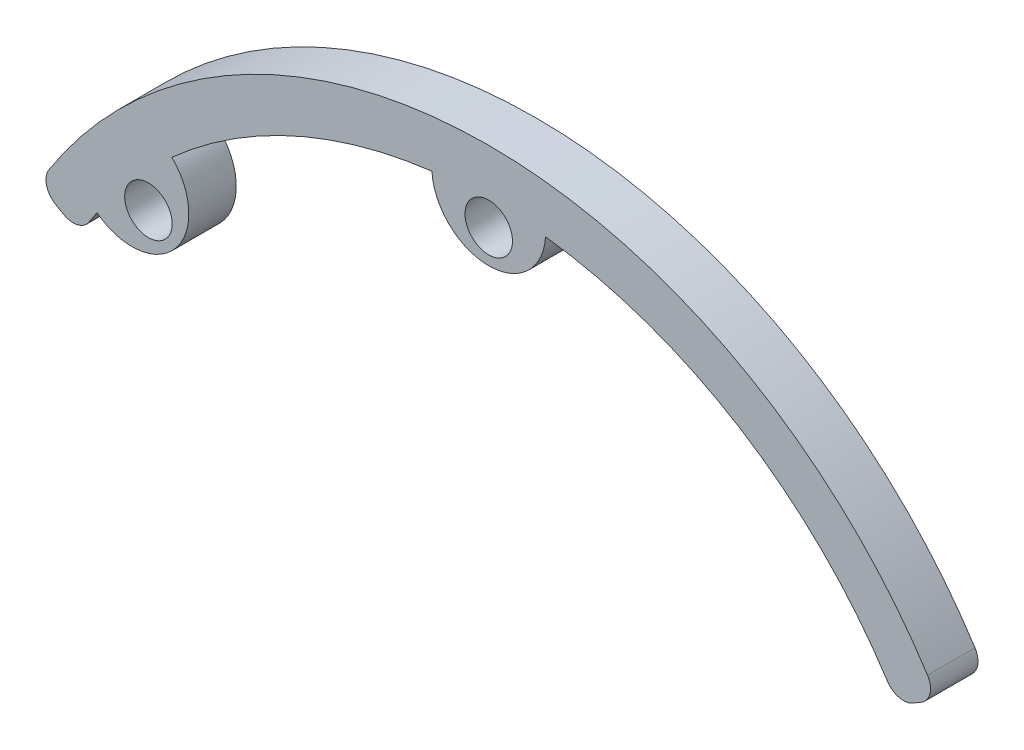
ISO-10303-21;
HEADER;
FILE_DESCRIPTION(('STEP AP214'),'2;1');
FILE_NAME('part.step','',(''),(''),'','','');
FILE_SCHEMA(('AUTOMOTIVE_DESIGN { 1 0 10303 214 1 1 1 1 }'));
ENDSEC;
DATA;
#1=APPLICATION_CONTEXT('core data for automotive mechanical design processes');
#2=APPLICATION_PROTOCOL_DEFINITION('international standard','automotive_design',2000,#1);
#3=PRODUCT_CONTEXT('',#1,'mechanical');
#4=PRODUCT('Part','Part','',(#3));
#5=PRODUCT_RELATED_PRODUCT_CATEGORY('part','',(#4));
#6=PRODUCT_DEFINITION_FORMATION('','',#4);
#7=PRODUCT_DEFINITION_CONTEXT('part definition',#1,'design');
#8=PRODUCT_DEFINITION('design','',#6,#7);
#9=PRODUCT_DEFINITION_SHAPE('','',#8);
#10=(LENGTH_UNIT() NAMED_UNIT(*) SI_UNIT(.MILLI.,.METRE.));
#11=(NAMED_UNIT(*) PLANE_ANGLE_UNIT() SI_UNIT($,.RADIAN.));
#12=(NAMED_UNIT(*) SI_UNIT($,.STERADIAN.) SOLID_ANGLE_UNIT());
#13=UNCERTAINTY_MEASURE_WITH_UNIT(LENGTH_MEASURE(1.E-05),#10,'distance_accuracy_value','');
#14=(GEOMETRIC_REPRESENTATION_CONTEXT(3) GLOBAL_UNCERTAINTY_ASSIGNED_CONTEXT((#13)) GLOBAL_UNIT_ASSIGNED_CONTEXT((#10,
#11,#12)) REPRESENTATION_CONTEXT('',''));
#15=CARTESIAN_POINT('',(0.,0.,0.));
#16=DIRECTION('',(0.,0.,1.));
#17=DIRECTION('',(1.,0.,0.));
#18=AXIS2_PLACEMENT_3D('',#15,#16,#17);
#19=CARTESIAN_POINT('',(0.,0.,5.));
#20=DIRECTION('',(0.506087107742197,0.862482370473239,0.));
#21=DIRECTION('',(-0.862482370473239,0.506087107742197,0.));
#22=AXIS2_PLACEMENT_3D('',#19,#20,#21);
#23=PLANE('',#22);
#24=DIRECTION('',(0.862482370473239,-0.506087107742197,0.));
#25=VECTOR('',#24,1.);
#26=CARTESIAN_POINT('',(0.,0.,5.));
#27=LINE('',#26,#25);
#28=CARTESIAN_POINT('',(-45.6790075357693,26.8035122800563,5.));
#29=VERTEX_POINT('',#28);
#30=CARTESIAN_POINT('',(-44.8158985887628,26.2970575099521,5.));
#31=VERTEX_POINT('',#30);
#32=EDGE_CURVE('E143',#29,#31,#27,.T.);
#33=ORIENTED_EDGE('',*,*,#32,.F.);
#34=DIRECTION('',(0.,0.,1.));
#35=VECTOR('',#34,1.);
#36=CARTESIAN_POINT('',(-45.6790075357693,26.8035122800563,0.));
#37=LINE('',#36,#35);
#38=CARTESIAN_POINT('',(-45.6790075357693,26.8035122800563,0.));
#39=VERTEX_POINT('',#38);
#40=EDGE_CURVE('E11',#29,#39,#37,.F.);
#41=ORIENTED_EDGE('',*,*,#40,.T.);
#42=DIRECTION('',(0.862482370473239,-0.506087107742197,0.));
#43=VECTOR('',#42,1.);
#44=CARTESIAN_POINT('',(0.,0.,0.));
#45=LINE('',#44,#43);
#46=CARTESIAN_POINT('',(-44.8158985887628,26.2970575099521,0.));
#47=VERTEX_POINT('',#46);
#48=EDGE_CURVE('E177',#39,#47,#45,.T.);
#49=ORIENTED_EDGE('',*,*,#48,.T.);
#50=DIRECTION('',(0.,0.,-1.));
#51=VECTOR('',#50,1.);
#52=CARTESIAN_POINT('',(-44.8158985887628,26.2970575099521,5.));
#53=LINE('',#52,#51);
#54=EDGE_CURVE('E202',#47,#31,#53,.F.);
#55=ORIENTED_EDGE('',*,*,#54,.T.);
#56=EDGE_LOOP('',(#33,#41,#49,#55));
#57=FACE_BOUND('',#56,.T.);
#58=ADVANCED_FACE('F43',(#57),#23,.F.);
#59=CARTESIAN_POINT('',(0.,0.,5.));
#60=DIRECTION('',(0.,0.,-1.));
#61=DIRECTION('',(-1.,0.,0.));
#62=AXIS2_PLACEMENT_3D('',#59,#60,#61);
#63=CYLINDRICAL_SURFACE('',#62,50.);
#64=CARTESIAN_POINT('',(0.,0.,5.));
#65=DIRECTION('',(0.,0.,1.));
#66=DIRECTION('',(1.,0.,0.));
#67=AXIS2_PLACEMENT_3D('',#64,#65,#66);
#68=CIRCLE('',#67,50.);
#69=CARTESIAN_POINT('',(-42.1189657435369,26.9442521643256,5.));
#70=VERTEX_POINT('',#69);
#71=CARTESIAN_POINT('',(-41.2875911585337,28.2016810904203,5.));
#72=VERTEX_POINT('',#71);
#73=EDGE_CURVE('E132',#70,#72,#68,.F.);
#74=ORIENTED_EDGE('',*,*,#73,.F.);
#75=DIRECTION('',(0.,0.,-1.));
#76=VECTOR('',#75,1.);
#77=CARTESIAN_POINT('',(-42.1189657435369,26.9442521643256,5.));
#78=LINE('',#77,#76);
#79=CARTESIAN_POINT('',(-42.1189657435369,26.9442521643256,0.));
#80=VERTEX_POINT('',#79);
#81=EDGE_CURVE('E154',#70,#80,#78,.T.);
#82=ORIENTED_EDGE('',*,*,#81,.T.);
#83=CARTESIAN_POINT('',(0.,0.,0.));
#84=DIRECTION('',(0.,0.,1.));
#85=DIRECTION('',(1.,0.,0.));
#86=AXIS2_PLACEMENT_3D('',#83,#84,#85);
#87=CIRCLE('',#86,50.);
#88=CARTESIAN_POINT('',(-41.2875911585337,28.2016810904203,0.));
#89=VERTEX_POINT('',#88);
#90=EDGE_CURVE('E151',#80,#89,#87,.F.);
#91=ORIENTED_EDGE('',*,*,#90,.T.);
#92=DIRECTION('',(0.,0.,-1.));
#93=VECTOR('',#92,1.);
#94=CARTESIAN_POINT('',(-41.2875911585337,28.2016810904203,5.));
#95=LINE('',#94,#93);
#96=EDGE_CURVE('E148',#72,#89,#95,.T.);
#97=ORIENTED_EDGE('',*,*,#96,.F.);
#98=EDGE_LOOP('',(#74,#82,#91,#97));
#99=FACE_BOUND('',#98,.T.);
#100=ADVANCED_FACE('F149',(#99),#63,.F.);
#101=CARTESIAN_POINT('',(-37.6122158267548,32.9442137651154,5.));
#102=DIRECTION('',(0.,0.,-1.));
#103=DIRECTION('',(-1.,0.,0.));
#104=AXIS2_PLACEMENT_3D('',#101,#102,#103);
#105=CYLINDRICAL_SURFACE('',#104,6.);
#106=CARTESIAN_POINT('',(-37.6122158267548,32.9442137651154,0.));
#107=DIRECTION('',(0.,0.,1.));
#108=DIRECTION('',(1.,0.,0.));
#109=AXIS2_PLACEMENT_3D('',#106,#107,#108);
#110=CIRCLE('',#109,6.);
#111=CARTESIAN_POINT('',(-33.3952245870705,37.2123497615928,0.));
#112=VERTEX_POINT('',#111);
#113=EDGE_CURVE('E180',#89,#112,#110,.T.);
#114=ORIENTED_EDGE('',*,*,#113,.T.);
#115=DIRECTION('',(0.,0.,-1.));
#116=VECTOR('',#115,1.);
#117=CARTESIAN_POINT('',(-33.3952245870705,37.2123497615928,5.));
#118=LINE('',#117,#116);
#119=CARTESIAN_POINT('',(-33.3952245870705,37.2123497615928,5.));
#120=VERTEX_POINT('',#119);
#121=EDGE_CURVE('E155',#120,#112,#118,.T.);
#122=ORIENTED_EDGE('',*,*,#121,.F.);
#123=CARTESIAN_POINT('',(-37.6122158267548,32.9442137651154,5.));
#124=DIRECTION('',(0.,0.,1.));
#125=DIRECTION('',(1.,0.,0.));
#126=AXIS2_PLACEMENT_3D('',#123,#124,#125);
#127=CIRCLE('',#126,6.);
#128=EDGE_CURVE('E136',#72,#120,#127,.T.);
#129=ORIENTED_EDGE('',*,*,#128,.F.);
#130=ORIENTED_EDGE('',*,*,#96,.T.);
#131=EDGE_LOOP('',(#114,#122,#129,#130));
#132=FACE_BOUND('',#131,.T.);
#133=ADVANCED_FACE('F157',(#132),#105,.T.);
#134=CARTESIAN_POINT('',(-5.98919026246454,49.64,0.));
#135=VERTEX_POINT('',#134);
#136=EDGE_CURVE('E182',#112,#135,#87,.F.);
#137=ORIENTED_EDGE('',*,*,#136,.T.);
#138=DIRECTION('',(0.,0.,-1.));
#139=VECTOR('',#138,1.);
#140=CARTESIAN_POINT('',(-5.98919026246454,49.64,5.));
#141=LINE('',#140,#139);
#142=CARTESIAN_POINT('',(-5.98919026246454,49.64,5.));
#143=VERTEX_POINT('',#142);
#144=EDGE_CURVE('E194',#143,#135,#141,.T.);
#145=ORIENTED_EDGE('',*,*,#144,.F.);
#146=EDGE_CURVE('E146',#120,#143,#68,.F.);
#147=ORIENTED_EDGE('',*,*,#146,.F.);
#148=ORIENTED_EDGE('',*,*,#121,.T.);
#149=EDGE_LOOP('',(#137,#145,#147,#148));
#150=FACE_BOUND('',#149,.T.);
#151=ADVANCED_FACE('F254',(#150),#63,.F.);
#152=CARTESIAN_POINT('',(0.,50.,5.));
#153=DIRECTION('',(0.,0.,-1.));
#154=DIRECTION('',(-1.,0.,0.));
#155=AXIS2_PLACEMENT_3D('',#152,#153,#154);
#156=CYLINDRICAL_SURFACE('',#155,6.);
#157=CARTESIAN_POINT('',(0.,50.,0.));
#158=DIRECTION('',(0.,0.,1.));
#159=DIRECTION('',(1.,0.,0.));
#160=AXIS2_PLACEMENT_3D('',#157,#158,#159);
#161=CIRCLE('',#160,6.);
#162=CARTESIAN_POINT('',(5.98919026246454,49.64,0.));
#163=VERTEX_POINT('',#162);
#164=EDGE_CURVE('E184',#135,#163,#161,.T.);
#165=ORIENTED_EDGE('',*,*,#164,.T.);
#166=DIRECTION('',(0.,0.,-1.));
#167=VECTOR('',#166,1.);
#168=CARTESIAN_POINT('',(5.98919026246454,49.64,5.));
#169=LINE('',#168,#167);
#170=CARTESIAN_POINT('',(5.98919026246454,49.64,5.));
#171=VERTEX_POINT('',#170);
#172=EDGE_CURVE('E170',#171,#163,#169,.T.);
#173=ORIENTED_EDGE('',*,*,#172,.F.);
#174=CARTESIAN_POINT('',(0.,50.,5.));
#175=DIRECTION('',(0.,0.,1.));
#176=DIRECTION('',(1.,0.,0.));
#177=AXIS2_PLACEMENT_3D('',#174,#175,#176);
#178=CIRCLE('',#177,6.);
#179=EDGE_CURVE('E161',#143,#171,#178,.T.);
#180=ORIENTED_EDGE('',*,*,#179,.F.);
#181=ORIENTED_EDGE('',*,*,#144,.T.);
#182=EDGE_LOOP('',(#165,#173,#180,#181));
#183=FACE_BOUND('',#182,.T.);
#184=ADVANCED_FACE('F257',(#183),#156,.T.);
#185=CARTESIAN_POINT('',(42.0280068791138,27.0859121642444,0.));
#186=VERTEX_POINT('',#185);
#187=EDGE_CURVE('E181',#163,#186,#87,.F.);
#188=ORIENTED_EDGE('',*,*,#187,.T.);
#189=DIRECTION('',(0.,0.,-1.));
#190=VECTOR('',#189,1.);
#191=CARTESIAN_POINT('',(42.0280068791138,27.0859121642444,5.));
#192=LINE('',#191,#190);
#193=CARTESIAN_POINT('',(42.0280068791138,27.0859121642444,5.));
#194=VERTEX_POINT('',#193);
#195=EDGE_CURVE('E211',#186,#194,#192,.F.);
#196=ORIENTED_EDGE('',*,*,#195,.T.);
#197=EDGE_CURVE('E145',#171,#194,#68,.F.);
#198=ORIENTED_EDGE('',*,*,#197,.F.);
#199=ORIENTED_EDGE('',*,*,#172,.T.);
#200=EDGE_LOOP('',(#188,#196,#198,#199));
#201=FACE_BOUND('',#200,.T.);
#202=ADVANCED_FACE('F247',(#201),#63,.F.);
#203=CARTESIAN_POINT('',(0.,0.,5.));
#204=DIRECTION('',(0.508988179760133,-0.860773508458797,0.));
#205=DIRECTION('',(0.860773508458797,0.508988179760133,0.));
#206=AXIS2_PLACEMENT_3D('',#203,#204,#205);
#207=PLANE('',#206);
#208=DIRECTION('',(-0.860773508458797,-0.508988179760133,0.));
#209=VECTOR('',#208,1.);
#210=CARTESIAN_POINT('',(0.,0.,0.));
#211=LINE('',#210,#209);
#212=CARTESIAN_POINT('',(45.588502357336,26.9571595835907,0.));
#213=VERTEX_POINT('',#212);
#214=CARTESIAN_POINT('',(44.7271035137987,26.4478016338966,0.));
#215=VERTEX_POINT('',#214);
#216=EDGE_CURVE('E186',#213,#215,#211,.T.);
#217=ORIENTED_EDGE('',*,*,#216,.F.);
#218=DIRECTION('',(0.,0.,-1.));
#219=VECTOR('',#218,1.);
#220=CARTESIAN_POINT('',(45.588502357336,26.9571595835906,5.));
#221=LINE('',#220,#219);
#222=CARTESIAN_POINT('',(45.588502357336,26.9571595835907,5.));
#223=VERTEX_POINT('',#222);
#224=EDGE_CURVE('E66',#213,#223,#221,.F.);
#225=ORIENTED_EDGE('',*,*,#224,.T.);
#226=DIRECTION('',(-0.860773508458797,-0.508988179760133,0.));
#227=VECTOR('',#226,1.);
#228=CARTESIAN_POINT('',(0.,0.,5.));
#229=LINE('',#228,#227);
#230=CARTESIAN_POINT('',(44.7271035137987,26.4478016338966,5.));
#231=VERTEX_POINT('',#230);
#232=EDGE_CURVE('E165',#223,#231,#229,.T.);
#233=ORIENTED_EDGE('',*,*,#232,.T.);
#234=DIRECTION('',(0.,0.,1.));
#235=VECTOR('',#234,1.);
#236=CARTESIAN_POINT('',(44.7271035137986,26.4478016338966,0.));
#237=LINE('',#236,#235);
#238=EDGE_CURVE('E206',#231,#215,#237,.F.);
#239=ORIENTED_EDGE('',*,*,#238,.T.);
#240=EDGE_LOOP('',(#217,#225,#233,#239));
#241=FACE_BOUND('',#240,.T.);
#242=ADVANCED_FACE('F237',(#241),#207,.T.);
#243=CARTESIAN_POINT('',(0.,47.5,5.));
#244=DIRECTION('',(0.,0.,-1.));
#245=DIRECTION('',(-1.,0.,0.));
#246=AXIS2_PLACEMENT_3D('',#243,#244,#245);
#247=CYLINDRICAL_SURFACE('',#246,2.5);
#248=CARTESIAN_POINT('',(0.,47.5,5.));
#249=DIRECTION('',(0.,0.,1.));
#250=DIRECTION('',(1.,0.,0.));
#251=AXIS2_PLACEMENT_3D('',#248,#249,#250);
#252=CIRCLE('',#251,2.5);
#253=CARTESIAN_POINT('',(2.50000000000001,47.5,5.));
#254=VERTEX_POINT('',#253);
#255=EDGE_CURVE('E298',#254,#254,#252,.T.);
#256=ORIENTED_EDGE('',*,*,#255,.T.);
#257=EDGE_LOOP('',(#256));
#258=FACE_BOUND('',#257,.T.);
#259=CARTESIAN_POINT('',(0.,47.5,0.));
#260=DIRECTION('',(0.,0.,1.));
#261=DIRECTION('',(1.,0.,0.));
#262=AXIS2_PLACEMENT_3D('',#259,#260,#261);
#263=CIRCLE('',#262,2.5);
#264=CARTESIAN_POINT('',(2.50000000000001,47.5,0.));
#265=VERTEX_POINT('',#264);
#266=EDGE_CURVE('E174',#265,#265,#263,.T.);
#267=ORIENTED_EDGE('',*,*,#266,.F.);
#268=EDGE_LOOP('',(#267));
#269=FACE_BOUND('',#268,.T.);
#270=ADVANCED_FACE('F276',(#258,#269),#247,.F.);
#271=CARTESIAN_POINT('',(-35.8689906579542,31.1394526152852,5.));
#272=DIRECTION('',(0.,0.,-1.));
#273=DIRECTION('',(-1.,0.,0.));
#274=AXIS2_PLACEMENT_3D('',#271,#272,#273);
#275=CYLINDRICAL_SURFACE('',#274,2.5);
#276=CARTESIAN_POINT('',(-35.8689906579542,31.1394526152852,5.));
#277=DIRECTION('',(0.,0.,1.));
#278=DIRECTION('',(1.,0.,0.));
#279=AXIS2_PLACEMENT_3D('',#276,#277,#278);
#280=CIRCLE('',#279,2.5);
#281=CARTESIAN_POINT('',(-33.3689906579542,31.1394526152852,5.));
#282=VERTEX_POINT('',#281);
#283=EDGE_CURVE('E191',#282,#282,#280,.T.);
#284=ORIENTED_EDGE('',*,*,#283,.T.);
#285=EDGE_LOOP('',(#284));
#286=FACE_BOUND('',#285,.T.);
#287=CARTESIAN_POINT('',(-35.8689906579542,31.1394526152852,0.));
#288=DIRECTION('',(0.,0.,1.));
#289=DIRECTION('',(1.,0.,0.));
#290=AXIS2_PLACEMENT_3D('',#287,#288,#289);
#291=CIRCLE('',#290,2.5);
#292=CARTESIAN_POINT('',(-33.3689906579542,31.1394526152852,0.));
#293=VERTEX_POINT('',#292);
#294=EDGE_CURVE('E171',#293,#293,#291,.T.);
#295=ORIENTED_EDGE('',*,*,#294,.F.);
#296=EDGE_LOOP('',(#295));
#297=FACE_BOUND('',#296,.T.);
#298=ADVANCED_FACE('F278',(#286,#297),#275,.F.);
#299=CARTESIAN_POINT('',(0.,0.,5.));
#300=DIRECTION('',(0.,0.,-1.));
#301=DIRECTION('',(-1.,0.,0.));
#302=AXIS2_PLACEMENT_3D('',#299,#300,#301);
#303=CYLINDRICAL_SURFACE('',#302,55.);
#304=CARTESIAN_POINT('',(0.,0.,5.));
#305=DIRECTION('',(0.,0.,1.));
#306=DIRECTION('',(1.,0.,0.));
#307=AXIS2_PLACEMENT_3D('',#304,#305,#306);
#308=CIRCLE('',#307,55.);
#309=CARTESIAN_POINT('',(-46.3523742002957,29.6050233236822,5.));
#310=VERTEX_POINT('',#309);
#311=CARTESIAN_POINT('',(46.2524326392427,29.7609219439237,5.));
#312=VERTEX_POINT('',#311);
#313=EDGE_CURVE('E167',#310,#312,#308,.F.);
#314=ORIENTED_EDGE('',*,*,#313,.T.);
#315=DIRECTION('',(0.,0.,-1.));
#316=VECTOR('',#315,1.);
#317=CARTESIAN_POINT('',(46.2524326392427,29.7609219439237,5.));
#318=LINE('',#317,#316);
#319=CARTESIAN_POINT('',(46.2524326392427,29.7609219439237,0.));
#320=VERTEX_POINT('',#319);
#321=EDGE_CURVE('E218',#312,#320,#318,.T.);
#322=ORIENTED_EDGE('',*,*,#321,.T.);
#323=CARTESIAN_POINT('',(0.,0.,0.));
#324=DIRECTION('',(0.,0.,1.));
#325=DIRECTION('',(1.,0.,0.));
#326=AXIS2_PLACEMENT_3D('',#323,#324,#325);
#327=CIRCLE('',#326,55.);
#328=CARTESIAN_POINT('',(-46.3523742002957,29.6050233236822,0.));
#329=VERTEX_POINT('',#328);
#330=EDGE_CURVE('E188',#329,#320,#327,.F.);
#331=ORIENTED_EDGE('',*,*,#330,.F.);
#332=DIRECTION('',(0.,0.,-1.));
#333=VECTOR('',#332,1.);
#334=CARTESIAN_POINT('',(-46.3523742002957,29.6050233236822,5.));
#335=LINE('',#334,#333);
#336=EDGE_CURVE('E216',#329,#310,#335,.F.);
#337=ORIENTED_EDGE('',*,*,#336,.T.);
#338=EDGE_LOOP('',(#314,#322,#331,#337));
#339=FACE_BOUND('',#338,.T.);
#340=ADVANCED_FACE('F230',(#339),#303,.T.);
#341=CARTESIAN_POINT('',(0.,0.,5.));
#342=DIRECTION('',(0.,0.,1.));
#343=DIRECTION('',(1.,0.,0.));
#344=AXIS2_PLACEMENT_3D('',#341,#342,#343);
#345=PLANE('',#344);
#346=ORIENTED_EDGE('',*,*,#283,.F.);
#347=EDGE_LOOP('',(#346));
#348=FACE_BOUND('',#347,.T.);
#349=ORIENTED_EDGE('',*,*,#255,.F.);
#350=EDGE_LOOP('',(#349));
#351=FACE_BOUND('',#350,.T.);
#352=ORIENTED_EDGE('',*,*,#232,.F.);
#353=CARTESIAN_POINT('',(44.5705259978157,28.6787066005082,5.));
#354=DIRECTION('',(0.,0.,1.));
#355=DIRECTION('',(1.,0.,0.));
#356=AXIS2_PLACEMENT_3D('',#353,#354,#355);
#357=CIRCLE('',#356,2.);
#358=EDGE_CURVE('E51',#223,#312,#357,.T.);
#359=ORIENTED_EDGE('',*,*,#358,.T.);
#360=ORIENTED_EDGE('',*,*,#313,.F.);
#361=CARTESIAN_POINT('',(-44.6668333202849,28.5284770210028,5.));
#362=DIRECTION('',(0.,0.,1.));
#363=DIRECTION('',(1.,0.,0.));
#364=AXIS2_PLACEMENT_3D('',#361,#362,#363);
#365=CIRCLE('',#364,2.);
#366=EDGE_CURVE('E58',#310,#29,#365,.T.);
#367=ORIENTED_EDGE('',*,*,#366,.T.);
#368=ORIENTED_EDGE('',*,*,#32,.T.);
#369=CARTESIAN_POINT('',(-43.8037243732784,28.0220222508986,5.));
#370=DIRECTION('',(0.,0.,1.));
#371=DIRECTION('',(1.,0.,0.));
#372=AXIS2_PLACEMENT_3D('',#369,#370,#371);
#373=CIRCLE('',#372,2.);
#374=EDGE_CURVE('E139',#31,#70,#373,.T.);
#375=ORIENTED_EDGE('',*,*,#374,.T.);
#376=ORIENTED_EDGE('',*,*,#73,.T.);
#377=ORIENTED_EDGE('',*,*,#128,.T.);
#378=ORIENTED_EDGE('',*,*,#146,.T.);
#379=ORIENTED_EDGE('',*,*,#179,.T.);
#380=ORIENTED_EDGE('',*,*,#197,.T.);
#381=CARTESIAN_POINT('',(43.7091271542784,28.1693486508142,5.));
#382=DIRECTION('',(0.,0.,1.));
#383=DIRECTION('',(1.,0.,0.));
#384=AXIS2_PLACEMENT_3D('',#381,#382,#383);
#385=CIRCLE('',#384,2.);
#386=EDGE_CURVE('E213',#194,#231,#385,.T.);
#387=ORIENTED_EDGE('',*,*,#386,.T.);
#388=EDGE_LOOP('',(#352,#359,#360,#367,#368,#375,#376,#377,#378,#379,#380,#387));
#389=FACE_BOUND('',#388,.T.);
#390=ADVANCED_FACE('F134',(#348,#351,#389),#345,.T.);
#391=CARTESIAN_POINT('',(0.,0.,0.));
#392=DIRECTION('',(0.,0.,1.));
#393=DIRECTION('',(1.,0.,0.));
#394=AXIS2_PLACEMENT_3D('',#391,#392,#393);
#395=PLANE('',#394);
#396=ORIENTED_EDGE('',*,*,#294,.T.);
#397=EDGE_LOOP('',(#396));
#398=FACE_BOUND('',#397,.T.);
#399=ORIENTED_EDGE('',*,*,#266,.T.);
#400=EDGE_LOOP('',(#399));
#401=FACE_BOUND('',#400,.T.);
#402=ORIENTED_EDGE('',*,*,#330,.T.);
#403=CARTESIAN_POINT('',(44.5705259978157,28.6787066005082,0.));
#404=DIRECTION('',(0.,0.,1.));
#405=DIRECTION('',(1.,0.,0.));
#406=AXIS2_PLACEMENT_3D('',#403,#404,#405);
#407=CIRCLE('',#406,2.);
#408=EDGE_CURVE('E223',#320,#213,#407,.F.);
#409=ORIENTED_EDGE('',*,*,#408,.T.);
#410=ORIENTED_EDGE('',*,*,#216,.T.);
#411=CARTESIAN_POINT('',(43.7091271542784,28.1693486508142,0.));
#412=DIRECTION('',(0.,0.,1.));
#413=DIRECTION('',(1.,0.,0.));
#414=AXIS2_PLACEMENT_3D('',#411,#412,#413);
#415=CIRCLE('',#414,2.);
#416=EDGE_CURVE('E209',#215,#186,#415,.F.);
#417=ORIENTED_EDGE('',*,*,#416,.T.);
#418=ORIENTED_EDGE('',*,*,#187,.F.);
#419=ORIENTED_EDGE('',*,*,#164,.F.);
#420=ORIENTED_EDGE('',*,*,#136,.F.);
#421=ORIENTED_EDGE('',*,*,#113,.F.);
#422=ORIENTED_EDGE('',*,*,#90,.F.);
#423=CARTESIAN_POINT('',(-43.8037243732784,28.0220222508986,0.));
#424=DIRECTION('',(0.,0.,1.));
#425=DIRECTION('',(1.,0.,0.));
#426=AXIS2_PLACEMENT_3D('',#423,#424,#425);
#427=CIRCLE('',#426,2.);
#428=EDGE_CURVE('E199',#80,#47,#427,.F.);
#429=ORIENTED_EDGE('',*,*,#428,.T.);
#430=ORIENTED_EDGE('',*,*,#48,.F.);
#431=CARTESIAN_POINT('',(-44.6668333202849,28.5284770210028,0.));
#432=DIRECTION('',(0.,0.,1.));
#433=DIRECTION('',(1.,0.,0.));
#434=AXIS2_PLACEMENT_3D('',#431,#432,#433);
#435=CIRCLE('',#434,2.);
#436=EDGE_CURVE('E221',#39,#329,#435,.F.);
#437=ORIENTED_EDGE('',*,*,#436,.T.);
#438=EDGE_LOOP('',(#402,#409,#410,#417,#418,#419,#420,#421,#422,#429,#430,#437));
#439=FACE_BOUND('',#438,.T.);
#440=ADVANCED_FACE('F235',(#398,#401,#439),#395,.F.);
#441=CARTESIAN_POINT('',(-43.8037243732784,28.0220222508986,5.));
#442=DIRECTION('',(0.,0.,-1.));
#443=DIRECTION('',(-1.,0.,0.));
#444=AXIS2_PLACEMENT_3D('',#441,#442,#443);
#445=CYLINDRICAL_SURFACE('',#444,2.);
#446=ORIENTED_EDGE('',*,*,#374,.F.);
#447=ORIENTED_EDGE('',*,*,#54,.F.);
#448=ORIENTED_EDGE('',*,*,#428,.F.);
#449=ORIENTED_EDGE('',*,*,#81,.F.);
#450=EDGE_LOOP('',(#446,#447,#448,#449));
#451=FACE_BOUND('',#450,.T.);
#452=ADVANCED_FACE('F283',(#451),#445,.T.);
#453=CARTESIAN_POINT('',(43.7091271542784,28.1693486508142,5.));
#454=DIRECTION('',(0.,0.,-1.));
#455=DIRECTION('',(-1.,0.,0.));
#456=AXIS2_PLACEMENT_3D('',#453,#454,#455);
#457=CYLINDRICAL_SURFACE('',#456,2.);
#458=ORIENTED_EDGE('',*,*,#386,.F.);
#459=ORIENTED_EDGE('',*,*,#195,.F.);
#460=ORIENTED_EDGE('',*,*,#416,.F.);
#461=ORIENTED_EDGE('',*,*,#238,.F.);
#462=EDGE_LOOP('',(#458,#459,#460,#461));
#463=FACE_BOUND('',#462,.T.);
#464=ADVANCED_FACE('F241',(#463),#457,.T.);
#465=CARTESIAN_POINT('',(44.5705259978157,28.6787066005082,5.));
#466=DIRECTION('',(0.,0.,-1.));
#467=DIRECTION('',(-1.,0.,0.));
#468=AXIS2_PLACEMENT_3D('',#465,#466,#467);
#469=CYLINDRICAL_SURFACE('',#468,2.);
#470=ORIENTED_EDGE('',*,*,#358,.F.);
#471=ORIENTED_EDGE('',*,*,#224,.F.);
#472=ORIENTED_EDGE('',*,*,#408,.F.);
#473=ORIENTED_EDGE('',*,*,#321,.F.);
#474=EDGE_LOOP('',(#470,#471,#472,#473));
#475=FACE_BOUND('',#474,.T.);
#476=ADVANCED_FACE('F233',(#475),#469,.T.);
#477=CARTESIAN_POINT('',(-44.6668333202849,28.5284770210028,5.));
#478=DIRECTION('',(0.,0.,-1.));
#479=DIRECTION('',(-1.,0.,0.));
#480=AXIS2_PLACEMENT_3D('',#477,#478,#479);
#481=CYLINDRICAL_SURFACE('',#480,2.);
#482=ORIENTED_EDGE('',*,*,#366,.F.);
#483=ORIENTED_EDGE('',*,*,#336,.F.);
#484=ORIENTED_EDGE('',*,*,#436,.F.);
#485=ORIENTED_EDGE('',*,*,#40,.F.);
#486=EDGE_LOOP('',(#482,#483,#484,#485));
#487=FACE_BOUND('',#486,.T.);
#488=ADVANCED_FACE('F45',(#487),#481,.T.);
#489=CLOSED_SHELL('',(#58,#100,#133,#151,#184,#202,#242,#270,#298,#340,#390,#440,#452,#464,#476,#488));
#490=MANIFOLD_SOLID_BREP('B2',#489);
#491=ADVANCED_BREP_SHAPE_REPRESENTATION('',(#18,#490),#14);
#492=SHAPE_DEFINITION_REPRESENTATION(#9,#491);
ENDSEC;
END-ISO-10303-21;
